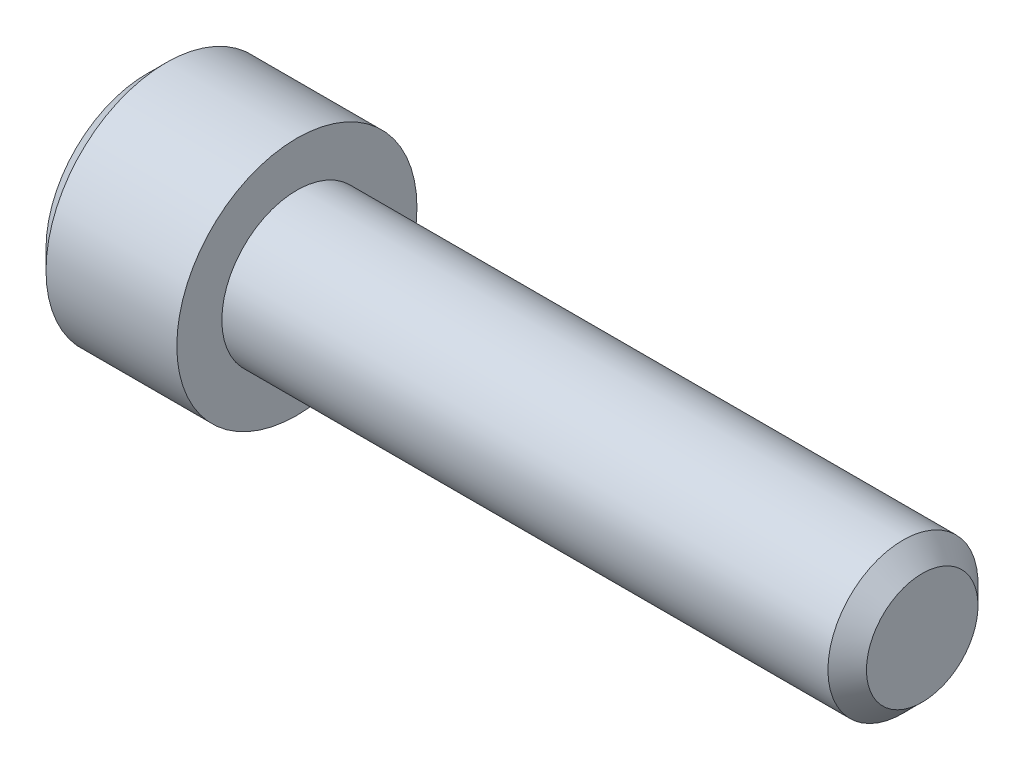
ISO-10303-21;
HEADER;
FILE_DESCRIPTION(('STEP AP214'),'2;1');
FILE_NAME('part.step','',(''),(''),'','','');
FILE_SCHEMA(('AUTOMOTIVE_DESIGN { 1 0 10303 214 1 1 1 1 }'));
ENDSEC;
DATA;
#1=APPLICATION_CONTEXT('core data for automotive mechanical design processes');
#2=APPLICATION_PROTOCOL_DEFINITION('international standard','automotive_design',2000,#1);
#3=PRODUCT_CONTEXT('',#1,'mechanical');
#4=PRODUCT('Part','Part','',(#3));
#5=PRODUCT_RELATED_PRODUCT_CATEGORY('part','',(#4));
#6=PRODUCT_DEFINITION_FORMATION('','',#4);
#7=PRODUCT_DEFINITION_CONTEXT('part definition',#1,'design');
#8=PRODUCT_DEFINITION('design','',#6,#7);
#9=PRODUCT_DEFINITION_SHAPE('','',#8);
#10=(LENGTH_UNIT() NAMED_UNIT(*) SI_UNIT(.MILLI.,.METRE.));
#11=(NAMED_UNIT(*) PLANE_ANGLE_UNIT() SI_UNIT($,.RADIAN.));
#12=(NAMED_UNIT(*) SI_UNIT($,.STERADIAN.) SOLID_ANGLE_UNIT());
#13=UNCERTAINTY_MEASURE_WITH_UNIT(LENGTH_MEASURE(1.E-05),#10,'distance_accuracy_value','');
#14=(GEOMETRIC_REPRESENTATION_CONTEXT(3) GLOBAL_UNCERTAINTY_ASSIGNED_CONTEXT((#13)) GLOBAL_UNIT_ASSIGNED_CONTEXT((#10,
#11,#12)) REPRESENTATION_CONTEXT('',''));
#15=CARTESIAN_POINT('',(0.,0.,0.));
#16=DIRECTION('',(0.,0.,1.));
#17=DIRECTION('',(1.,0.,0.));
#18=AXIS2_PLACEMENT_3D('',#15,#16,#17);
#19=CARTESIAN_POINT('',(0.,0.76199999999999,0.));
#20=DIRECTION('',(-1.,0.,0.));
#21=DIRECTION('',(0.,0.,1.));
#22=AXIS2_PLACEMENT_3D('',#19,#20,#21);
#23=PLANE('',#22);
#24=CARTESIAN_POINT('',(0.,0.,0.));
#25=DIRECTION('',(-1.,0.,0.));
#26=DIRECTION('',(0.,0.,1.));
#27=AXIS2_PLACEMENT_3D('',#24,#25,#26);
#28=CIRCLE('',#27,1.2192);
#29=CARTESIAN_POINT('',(0.,0.,1.2192));
#30=VERTEX_POINT('',#29);
#31=EDGE_CURVE('E11',#30,#30,#28,.T.);
#32=ORIENTED_EDGE('',*,*,#31,.F.);
#33=EDGE_LOOP('',(#32));
#34=FACE_BOUND('',#33,.T.);
#35=CARTESIAN_POINT('',(0.,0.,0.));
#36=DIRECTION('',(-1.,0.,0.));
#37=DIRECTION('',(0.,0.,1.));
#38=AXIS2_PLACEMENT_3D('',#35,#36,#37);
#39=CIRCLE('',#38,0.762);
#40=CARTESIAN_POINT('',(0.,0.,0.762));
#41=VERTEX_POINT('',#40);
#42=EDGE_CURVE('E143',#41,#41,#39,.T.);
#43=ORIENTED_EDGE('',*,*,#42,.T.);
#44=EDGE_LOOP('',(#43));
#45=FACE_BOUND('',#44,.T.);
#46=ADVANCED_FACE('F40',(#34,#45),#23,.F.);
#47=CARTESIAN_POINT('',(-51.524,0.,0.));
#48=DIRECTION('',(-1.,0.,0.));
#49=DIRECTION('',(0.,0.,1.));
#50=AXIS2_PLACEMENT_3D('',#47,#48,#49);
#51=CYLINDRICAL_SURFACE('',#50,1.2192);
#52=CARTESIAN_POINT('',(-1.32842,0.,0.));
#53=DIRECTION('',(-1.,0.,0.));
#54=DIRECTION('',(0.,0.,1.));
#55=AXIS2_PLACEMENT_3D('',#52,#53,#54);
#56=CIRCLE('',#55,1.2192);
#57=CARTESIAN_POINT('',(-1.32842,0.,1.2192));
#58=VERTEX_POINT('',#57);
#59=EDGE_CURVE('E47',#58,#58,#56,.T.);
#60=ORIENTED_EDGE('',*,*,#59,.F.);
#61=EDGE_LOOP('',(#60));
#62=FACE_BOUND('',#61,.T.);
#63=ORIENTED_EDGE('',*,*,#31,.T.);
#64=EDGE_LOOP('',(#63));
#65=FACE_BOUND('',#64,.T.);
#66=ADVANCED_FACE('F164',(#62,#65),#51,.T.);
#67=CARTESIAN_POINT('',(-1.32842,0.,0.));
#68=DIRECTION('',(1.,0.,0.));
#69=DIRECTION('',(0.,0.,-1.));
#70=AXIS2_PLACEMENT_3D('',#67,#68,#69);
#71=CONICAL_SURFACE('',#70,1.2192,0.785398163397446);
#72=CARTESIAN_POINT('',(-1.524,0.,0.));
#73=DIRECTION('',(-1.,0.,0.));
#74=DIRECTION('',(0.,0.,1.));
#75=AXIS2_PLACEMENT_3D('',#72,#73,#74);
#76=CIRCLE('',#75,1.02362);
#77=CARTESIAN_POINT('',(-1.524,0.,1.02362));
#78=VERTEX_POINT('',#77);
#79=EDGE_CURVE('E157',#78,#78,#76,.T.);
#80=ORIENTED_EDGE('',*,*,#79,.F.);
#81=EDGE_LOOP('',(#80));
#82=FACE_BOUND('',#81,.T.);
#83=ORIENTED_EDGE('',*,*,#59,.T.);
#84=EDGE_LOOP('',(#83));
#85=FACE_BOUND('',#84,.T.);
#86=ADVANCED_FACE('F162',(#82,#85),#71,.T.);
#87=CARTESIAN_POINT('',(-1.524,1.02361999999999,0.));
#88=DIRECTION('',(1.,0.,0.));
#89=DIRECTION('',(0.,0.,-1.));
#90=AXIS2_PLACEMENT_3D('',#87,#88,#89);
#91=PLANE('',#90);
#92=DIRECTION('',(0.,0.866025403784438,-0.500000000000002));
#93=VECTOR('',#92,1.);
#94=CARTESIAN_POINT('',(-1.524,-0.634999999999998,-0.366617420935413));
#95=LINE('',#94,#93);
#96=CARTESIAN_POINT('',(-1.524,-0.634999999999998,-0.366617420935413));
#97=VERTEX_POINT('',#96);
#98=CARTESIAN_POINT('',(-1.524,0.,-0.733234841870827));
#99=VERTEX_POINT('',#98);
#100=EDGE_CURVE('E129',#97,#99,#95,.T.);
#101=ORIENTED_EDGE('',*,*,#100,.T.);
#102=DIRECTION('',(0.,-0.866025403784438,-0.500000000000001));
#103=VECTOR('',#102,1.);
#104=CARTESIAN_POINT('',(-1.524,0.635000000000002,-0.366617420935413));
#105=LINE('',#104,#103);
#106=CARTESIAN_POINT('',(-1.524,0.635000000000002,-0.366617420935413));
#107=VERTEX_POINT('',#106);
#108=EDGE_CURVE('E54',#107,#99,#105,.T.);
#109=ORIENTED_EDGE('',*,*,#108,.F.);
#110=DIRECTION('',(0.,0.,1.));
#111=VECTOR('',#110,1.);
#112=CARTESIAN_POINT('',(-1.524,0.635000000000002,-0.366617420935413));
#113=LINE('',#112,#111);
#114=CARTESIAN_POINT('',(-1.524,0.635000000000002,0.366617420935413));
#115=VERTEX_POINT('',#114);
#116=EDGE_CURVE('E138',#107,#115,#113,.T.);
#117=ORIENTED_EDGE('',*,*,#116,.T.);
#118=DIRECTION('',(0.,-0.866025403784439,0.5));
#119=VECTOR('',#118,1.);
#120=CARTESIAN_POINT('',(-1.524,0.635000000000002,0.366617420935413));
#121=LINE('',#120,#119);
#122=CARTESIAN_POINT('',(-1.524,0.,0.733234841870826));
#123=VERTEX_POINT('',#122);
#124=EDGE_CURVE('E136',#115,#123,#121,.T.);
#125=ORIENTED_EDGE('',*,*,#124,.T.);
#126=DIRECTION('',(0.,0.866025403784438,0.500000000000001));
#127=VECTOR('',#126,1.);
#128=CARTESIAN_POINT('',(-1.524,-0.634999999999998,0.366617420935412));
#129=LINE('',#128,#127);
#130=CARTESIAN_POINT('',(-1.524,-0.634999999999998,0.366617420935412));
#131=VERTEX_POINT('',#130);
#132=EDGE_CURVE('E114',#131,#123,#129,.T.);
#133=ORIENTED_EDGE('',*,*,#132,.F.);
#134=DIRECTION('',(0.,0.,1.));
#135=VECTOR('',#134,1.);
#136=CARTESIAN_POINT('',(-1.524,-0.634999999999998,-0.366617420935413));
#137=LINE('',#136,#135);
#138=EDGE_CURVE('E132',#97,#131,#137,.T.);
#139=ORIENTED_EDGE('',*,*,#138,.F.);
#140=EDGE_LOOP('',(#101,#109,#117,#125,#133,#139));
#141=FACE_BOUND('',#140,.T.);
#142=ORIENTED_EDGE('',*,*,#79,.T.);
#143=EDGE_LOOP('',(#142));
#144=FACE_BOUND('',#143,.T.);
#145=ADVANCED_FACE('F192',(#141,#144),#91,.F.);
#146=CARTESIAN_POINT('',(6.35,0.566419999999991,0.));
#147=DIRECTION('',(1.,0.,0.));
#148=DIRECTION('',(0.,0.,-1.));
#149=AXIS2_PLACEMENT_3D('',#146,#147,#148);
#150=PLANE('',#149);
#151=CARTESIAN_POINT('',(6.35,0.,0.));
#152=DIRECTION('',(-1.,0.,0.));
#153=DIRECTION('',(0.,0.,1.));
#154=AXIS2_PLACEMENT_3D('',#151,#152,#153);
#155=CIRCLE('',#154,0.56642);
#156=CARTESIAN_POINT('',(6.35,0.,0.56642));
#157=VERTEX_POINT('',#156);
#158=EDGE_CURVE('E154',#157,#157,#155,.T.);
#159=ORIENTED_EDGE('',*,*,#158,.F.);
#160=EDGE_LOOP('',(#159));
#161=FACE_BOUND('',#160,.T.);
#162=ADVANCED_FACE('F185',(#161),#150,.T.);
#163=CARTESIAN_POINT('',(6.15442,0.,0.));
#164=DIRECTION('',(-1.,0.,0.));
#165=DIRECTION('',(0.,0.,1.));
#166=AXIS2_PLACEMENT_3D('',#163,#164,#165);
#167=CONICAL_SURFACE('',#166,0.762,0.785398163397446);
#168=ORIENTED_EDGE('',*,*,#158,.T.);
#169=EDGE_LOOP('',(#168));
#170=FACE_BOUND('',#169,.T.);
#171=CARTESIAN_POINT('',(6.15442,0.,0.));
#172=DIRECTION('',(-1.,0.,0.));
#173=DIRECTION('',(0.,0.,1.));
#174=AXIS2_PLACEMENT_3D('',#171,#172,#173);
#175=CIRCLE('',#174,0.762);
#176=CARTESIAN_POINT('',(6.15442,0.,0.762));
#177=VERTEX_POINT('',#176);
#178=EDGE_CURVE('E151',#177,#177,#175,.T.);
#179=ORIENTED_EDGE('',*,*,#178,.F.);
#180=EDGE_LOOP('',(#179));
#181=FACE_BOUND('',#180,.T.);
#182=ADVANCED_FACE('F176',(#170,#181),#167,.T.);
#183=CARTESIAN_POINT('',(-51.524,0.,0.));
#184=DIRECTION('',(-1.,0.,0.));
#185=DIRECTION('',(0.,0.,1.));
#186=AXIS2_PLACEMENT_3D('',#183,#184,#185);
#187=CYLINDRICAL_SURFACE('',#186,0.762);
#188=ORIENTED_EDGE('',*,*,#178,.T.);
#189=EDGE_LOOP('',(#188));
#190=FACE_BOUND('',#189,.T.);
#191=ORIENTED_EDGE('',*,*,#42,.F.);
#192=EDGE_LOOP('',(#191));
#193=FACE_BOUND('',#192,.T.);
#194=ADVANCED_FACE('F173',(#190,#193),#187,.T.);
#195=CARTESIAN_POINT('',(-0.888999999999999,0.635000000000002,-0.366617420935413));
#196=DIRECTION('',(0.,0.500000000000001,-0.866025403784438));
#197=DIRECTION('',(0.,0.866025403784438,0.500000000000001));
#198=AXIS2_PLACEMENT_3D('',#195,#196,#197);
#199=PLANE('',#198);
#200=ORIENTED_EDGE('',*,*,#108,.T.);
#201=DIRECTION('',(-1.,0.,0.));
#202=VECTOR('',#201,1.);
#203=CARTESIAN_POINT('',(-0.888999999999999,0.,-0.733234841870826));
#204=LINE('',#203,#202);
#205=CARTESIAN_POINT('',(-0.888999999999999,0.,-0.733234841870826));
#206=VERTEX_POINT('',#205);
#207=EDGE_CURVE('E127',#206,#99,#204,.T.);
#208=ORIENTED_EDGE('',*,*,#207,.F.);
#209=DIRECTION('',(0.,-0.866025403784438,-0.500000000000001));
#210=VECTOR('',#209,1.);
#211=CARTESIAN_POINT('',(-0.888999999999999,0.635000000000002,-0.366617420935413));
#212=LINE('',#211,#210);
#213=CARTESIAN_POINT('',(-0.888999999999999,0.635000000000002,-0.366617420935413));
#214=VERTEX_POINT('',#213);
#215=EDGE_CURVE('E141',#214,#206,#212,.T.);
#216=ORIENTED_EDGE('',*,*,#215,.F.);
#217=DIRECTION('',(-1.,0.,0.));
#218=VECTOR('',#217,1.);
#219=CARTESIAN_POINT('',(-0.888999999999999,0.635000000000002,-0.366617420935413));
#220=LINE('',#219,#218);
#221=EDGE_CURVE('E62',#214,#107,#220,.T.);
#222=ORIENTED_EDGE('',*,*,#221,.T.);
#223=EDGE_LOOP('',(#200,#208,#216,#222));
#224=FACE_BOUND('',#223,.T.);
#225=ADVANCED_FACE('F175',(#224),#199,.F.);
#226=CARTESIAN_POINT('',(-0.888999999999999,0.635000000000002,-0.366617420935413));
#227=DIRECTION('',(0.,-1.,0.));
#228=DIRECTION('',(0.,0.,-1.));
#229=AXIS2_PLACEMENT_3D('',#226,#227,#228);
#230=PLANE('',#229);
#231=ORIENTED_EDGE('',*,*,#116,.F.);
#232=ORIENTED_EDGE('',*,*,#221,.F.);
#233=DIRECTION('',(0.,0.,1.));
#234=VECTOR('',#233,1.);
#235=CARTESIAN_POINT('',(-0.888999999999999,0.635000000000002,-0.366617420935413));
#236=LINE('',#235,#234);
#237=CARTESIAN_POINT('',(-0.888999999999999,0.635000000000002,0.366617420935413));
#238=VERTEX_POINT('',#237);
#239=EDGE_CURVE('E106',#214,#238,#236,.T.);
#240=ORIENTED_EDGE('',*,*,#239,.T.);
#241=DIRECTION('',(-1.,0.,0.));
#242=VECTOR('',#241,1.);
#243=CARTESIAN_POINT('',(-0.888999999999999,0.635000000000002,0.366617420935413));
#244=LINE('',#243,#242);
#245=EDGE_CURVE('E103',#238,#115,#244,.T.);
#246=ORIENTED_EDGE('',*,*,#245,.T.);
#247=EDGE_LOOP('',(#231,#232,#240,#246));
#248=FACE_BOUND('',#247,.T.);
#249=ADVANCED_FACE('F183',(#248),#230,.T.);
#250=CARTESIAN_POINT('',(-0.888999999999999,0.635000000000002,0.366617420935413));
#251=DIRECTION('',(0.,-0.5,-0.866025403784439));
#252=DIRECTION('',(0.,0.866025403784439,-0.5));
#253=AXIS2_PLACEMENT_3D('',#250,#251,#252);
#254=PLANE('',#253);
#255=ORIENTED_EDGE('',*,*,#124,.F.);
#256=ORIENTED_EDGE('',*,*,#245,.F.);
#257=DIRECTION('',(0.,-0.866025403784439,0.5));
#258=VECTOR('',#257,1.);
#259=CARTESIAN_POINT('',(-0.888999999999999,0.635000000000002,0.366617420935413));
#260=LINE('',#259,#258);
#261=CARTESIAN_POINT('',(-0.888999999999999,0.,0.733234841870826));
#262=VERTEX_POINT('',#261);
#263=EDGE_CURVE('E97',#238,#262,#260,.T.);
#264=ORIENTED_EDGE('',*,*,#263,.T.);
#265=DIRECTION('',(-1.,0.,0.));
#266=VECTOR('',#265,1.);
#267=CARTESIAN_POINT('',(-0.888999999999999,0.,0.733234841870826));
#268=LINE('',#267,#266);
#269=EDGE_CURVE('E101',#262,#123,#268,.T.);
#270=ORIENTED_EDGE('',*,*,#269,.T.);
#271=EDGE_LOOP('',(#255,#256,#264,#270));
#272=FACE_BOUND('',#271,.T.);
#273=ADVANCED_FACE('F100',(#272),#254,.T.);
#274=CARTESIAN_POINT('',(-0.888999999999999,-0.634999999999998,0.366617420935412));
#275=DIRECTION('',(0.,-0.500000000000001,0.866025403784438));
#276=DIRECTION('',(0.,-0.866025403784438,-0.500000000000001));
#277=AXIS2_PLACEMENT_3D('',#274,#275,#276);
#278=PLANE('',#277);
#279=ORIENTED_EDGE('',*,*,#132,.T.);
#280=ORIENTED_EDGE('',*,*,#269,.F.);
#281=DIRECTION('',(0.,0.866025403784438,0.500000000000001));
#282=VECTOR('',#281,1.);
#283=CARTESIAN_POINT('',(-0.888999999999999,-0.634999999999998,0.366617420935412));
#284=LINE('',#283,#282);
#285=CARTESIAN_POINT('',(-0.888999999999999,-0.634999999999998,0.366617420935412));
#286=VERTEX_POINT('',#285);
#287=EDGE_CURVE('E107',#286,#262,#284,.T.);
#288=ORIENTED_EDGE('',*,*,#287,.F.);
#289=DIRECTION('',(-1.,0.,0.));
#290=VECTOR('',#289,1.);
#291=CARTESIAN_POINT('',(-0.888999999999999,-0.634999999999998,0.366617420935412));
#292=LINE('',#291,#290);
#293=EDGE_CURVE('E116',#286,#131,#292,.T.);
#294=ORIENTED_EDGE('',*,*,#293,.T.);
#295=EDGE_LOOP('',(#279,#280,#288,#294));
#296=FACE_BOUND('',#295,.T.);
#297=ADVANCED_FACE('F111',(#296),#278,.F.);
#298=CARTESIAN_POINT('',(-0.888999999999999,-0.634999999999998,-0.366617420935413));
#299=DIRECTION('',(0.,-1.,0.));
#300=DIRECTION('',(0.,0.,-1.));
#301=AXIS2_PLACEMENT_3D('',#298,#299,#300);
#302=PLANE('',#301);
#303=ORIENTED_EDGE('',*,*,#138,.T.);
#304=ORIENTED_EDGE('',*,*,#293,.F.);
#305=DIRECTION('',(0.,0.,1.));
#306=VECTOR('',#305,1.);
#307=CARTESIAN_POINT('',(-0.888999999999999,-0.634999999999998,-0.366617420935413));
#308=LINE('',#307,#306);
#309=CARTESIAN_POINT('',(-0.888999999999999,-0.634999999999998,-0.366617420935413));
#310=VERTEX_POINT('',#309);
#311=EDGE_CURVE('E121',#310,#286,#308,.T.);
#312=ORIENTED_EDGE('',*,*,#311,.F.);
#313=DIRECTION('',(-1.,0.,0.));
#314=VECTOR('',#313,1.);
#315=CARTESIAN_POINT('',(-0.888999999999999,-0.634999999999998,-0.366617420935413));
#316=LINE('',#315,#314);
#317=EDGE_CURVE('E146',#310,#97,#316,.T.);
#318=ORIENTED_EDGE('',*,*,#317,.T.);
#319=EDGE_LOOP('',(#303,#304,#312,#318));
#320=FACE_BOUND('',#319,.T.);
#321=ADVANCED_FACE('F268',(#320),#302,.F.);
#322=CARTESIAN_POINT('',(-0.888999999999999,-0.634999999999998,-0.366617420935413));
#323=DIRECTION('',(0.,0.500000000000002,0.866025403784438));
#324=DIRECTION('',(0.,-0.866025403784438,0.500000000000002));
#325=AXIS2_PLACEMENT_3D('',#322,#323,#324);
#326=PLANE('',#325);
#327=ORIENTED_EDGE('',*,*,#100,.F.);
#328=ORIENTED_EDGE('',*,*,#317,.F.);
#329=DIRECTION('',(0.,0.866025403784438,-0.500000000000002));
#330=VECTOR('',#329,1.);
#331=CARTESIAN_POINT('',(-0.888999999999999,-0.634999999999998,-0.366617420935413));
#332=LINE('',#331,#330);
#333=EDGE_CURVE('E88',#310,#206,#332,.T.);
#334=ORIENTED_EDGE('',*,*,#333,.T.);
#335=ORIENTED_EDGE('',*,*,#207,.T.);
#336=EDGE_LOOP('',(#327,#328,#334,#335));
#337=FACE_BOUND('',#336,.T.);
#338=ADVANCED_FACE('F276',(#337),#326,.T.);
#339=CARTESIAN_POINT('',(-0.888999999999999,0.,-0.733234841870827));
#340=DIRECTION('',(1.,0.,0.));
#341=DIRECTION('',(0.,0.,-1.));
#342=AXIS2_PLACEMENT_3D('',#339,#340,#341);
#343=PLANE('',#342);
#344=ORIENTED_EDGE('',*,*,#215,.T.);
#345=ORIENTED_EDGE('',*,*,#333,.F.);
#346=ORIENTED_EDGE('',*,*,#311,.T.);
#347=ORIENTED_EDGE('',*,*,#287,.T.);
#348=ORIENTED_EDGE('',*,*,#263,.F.);
#349=ORIENTED_EDGE('',*,*,#239,.F.);
#350=EDGE_LOOP('',(#344,#345,#346,#347,#348,#349));
#351=FACE_BOUND('',#350,.T.);
#352=ADVANCED_FACE('F119',(#351),#343,.F.);
#353=CLOSED_SHELL('',(#46,#66,#86,#145,#162,#182,#194,#225,#249,#273,#297,#321,#338,#352));
#354=MANIFOLD_SOLID_BREP('B2',#353);
#355=ADVANCED_BREP_SHAPE_REPRESENTATION('',(#18,#354),#14);
#356=SHAPE_DEFINITION_REPRESENTATION(#9,#355);
ENDSEC;
END-ISO-10303-21;
